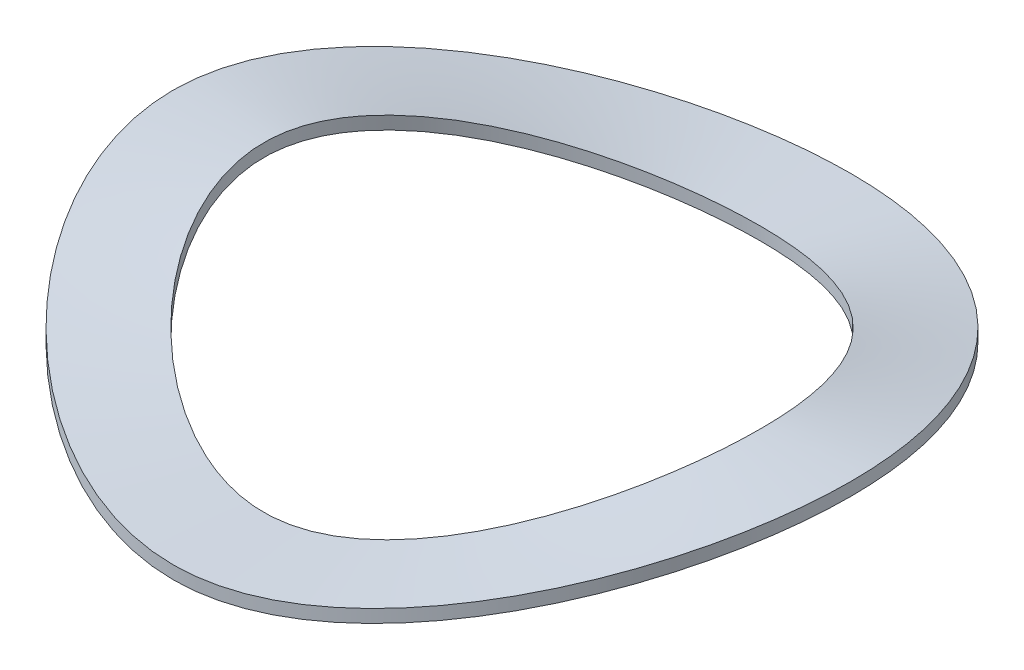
ISO-10303-21;
HEADER;
FILE_DESCRIPTION(('STEP AP214'),'2;1');
FILE_NAME('part.step','',(''),(''),'','','');
FILE_SCHEMA(('AUTOMOTIVE_DESIGN { 1 0 10303 214 1 1 1 1 }'));
ENDSEC;
DATA;
#1=APPLICATION_CONTEXT('core data for automotive mechanical design processes');
#2=APPLICATION_PROTOCOL_DEFINITION('international standard','automotive_design',2000,#1);
#3=PRODUCT_CONTEXT('',#1,'mechanical');
#4=PRODUCT('Part','Part','',(#3));
#5=PRODUCT_RELATED_PRODUCT_CATEGORY('part','',(#4));
#6=PRODUCT_DEFINITION_FORMATION('','',#4);
#7=PRODUCT_DEFINITION_CONTEXT('part definition',#1,'design');
#8=PRODUCT_DEFINITION('design','',#6,#7);
#9=PRODUCT_DEFINITION_SHAPE('','',#8);
#10=(LENGTH_UNIT() NAMED_UNIT(*) SI_UNIT(.MILLI.,.METRE.));
#11=(NAMED_UNIT(*) PLANE_ANGLE_UNIT() SI_UNIT($,.RADIAN.));
#12=(NAMED_UNIT(*) SI_UNIT($,.STERADIAN.) SOLID_ANGLE_UNIT());
#13=UNCERTAINTY_MEASURE_WITH_UNIT(LENGTH_MEASURE(1.E-05),#10,'distance_accuracy_value','');
#14=(GEOMETRIC_REPRESENTATION_CONTEXT(3) GLOBAL_UNCERTAINTY_ASSIGNED_CONTEXT((#13)) GLOBAL_UNIT_ASSIGNED_CONTEXT((#10,
#11,#12)) REPRESENTATION_CONTEXT('',''));
#15=CARTESIAN_POINT('',(0.,0.,0.));
#16=DIRECTION('',(0.,0.,1.));
#17=DIRECTION('',(1.,0.,0.));
#18=AXIS2_PLACEMENT_3D('',#15,#16,#17);
#19=CARTESIAN_POINT('',(0.,0.0888999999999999,-1.7018));
#20=CARTESIAN_POINT('',(0.8509,0.0889,-1.7018));
#21=CARTESIAN_POINT('',(2.5527,1.0795,0.));
#22=CARTESIAN_POINT('',(0.,-0.4064,2.5527));
#23=CARTESIAN_POINT('',(-2.5527,1.0795,0.));
#24=CARTESIAN_POINT('',(-0.8509,0.0888999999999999,-1.7018));
#25=CARTESIAN_POINT('',(0.,0.0888999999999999,-1.7018));
#26=CARTESIAN_POINT('',(0.,0.,-1.7018));
#27=CARTESIAN_POINT('',(0.8509,0.,-1.7018));
#28=CARTESIAN_POINT('',(2.5527,0.9906,0.));
#29=CARTESIAN_POINT('',(0.,-0.4953,2.5527));
#30=CARTESIAN_POINT('',(-2.5527,0.9906,0.));
#31=CARTESIAN_POINT('',(-0.8509,0.,-1.7018));
#32=CARTESIAN_POINT('',(0.,0.,-1.7018));
#33=B_SPLINE_SURFACE_WITH_KNOTS('',1,3,((#19,#20,#21,#22,#23,#24,#25),(#26,#27,#28,#29,#30,#31,
#32)),.UNSPECIFIED.,.F.,.T.,.F.,(2,2),(4,1,1,1,4),(0.,1.),(0.,0.25,0.5,0.75,1.),.UNSPECIFIED.);
#34=CARTESIAN_POINT('',(0.,0.0888999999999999,-1.7018));
#35=CARTESIAN_POINT('',(0.8509,0.0889,-1.7018));
#36=CARTESIAN_POINT('',(2.5527,1.0795,0.));
#37=CARTESIAN_POINT('',(0.,-0.4064,2.5527));
#38=CARTESIAN_POINT('',(-2.5527,1.0795,0.));
#39=CARTESIAN_POINT('',(-0.8509,0.0888999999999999,-1.7018));
#40=CARTESIAN_POINT('',(0.,0.0888999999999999,-1.7018));
#41=B_SPLINE_CURVE_WITH_KNOTS('',3,(#34,#35,#36,#37,#38,#39,#40),.UNSPECIFIED.,.T.,.F.,(4,1,1,1,
4),(0.,0.25,0.5,0.75,1.),.UNSPECIFIED.);
#42=CARTESIAN_POINT('',(0.,0.0888999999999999,-1.7018));
#43=VERTEX_POINT('',#42);
#44=EDGE_CURVE('E10',#43,#43,#41,.F.);
#45=CARTESIAN_POINT('',(0.,0.,-1.7018));
#46=CARTESIAN_POINT('',(0.8509,0.,-1.7018));
#47=CARTESIAN_POINT('',(2.5527,0.9906,0.));
#48=CARTESIAN_POINT('',(0.,-0.4953,2.5527));
#49=CARTESIAN_POINT('',(-2.5527,0.9906,0.));
#50=CARTESIAN_POINT('',(-0.8509,0.,-1.7018));
#51=CARTESIAN_POINT('',(0.,0.,-1.7018));
#52=B_SPLINE_CURVE_WITH_KNOTS('',3,(#45,#46,#47,#48,#49,#50,#51),.UNSPECIFIED.,.T.,.F.,(4,1,1,1,
4),(0.,0.25,0.5,0.75,1.),.UNSPECIFIED.);
#53=CARTESIAN_POINT('',(0.,0.,-1.7018));
#54=VERTEX_POINT('',#53);
#55=EDGE_CURVE('E48',#54,#54,#52,.T.);
#56=ORIENTED_EDGE('',*,*,#44,.T.);
#57=EDGE_LOOP('',(#56));
#58=FACE_BOUND('',#57,.T.);
#59=ORIENTED_EDGE('',*,*,#55,.T.);
#60=EDGE_LOOP('',(#59));
#61=FACE_BOUND('',#60,.T.);
#62=ADVANCED_FACE('F36',(#58,#61),#33,.T.);
#63=CARTESIAN_POINT('',(0.,0.0889,-2.3241));
#64=CARTESIAN_POINT('',(1.16205,0.0889,-2.3241));
#65=CARTESIAN_POINT('',(3.48615,1.0795,0.));
#66=CARTESIAN_POINT('',(0.,-0.4064,3.48615));
#67=CARTESIAN_POINT('',(-3.48615,1.0795,0.));
#68=CARTESIAN_POINT('',(-1.16205,0.0888999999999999,-2.3241));
#69=CARTESIAN_POINT('',(0.,0.0889,-2.3241));
#70=CARTESIAN_POINT('',(0.,0.0889,-1.7018));
#71=CARTESIAN_POINT('',(0.8509,0.0889,-1.7018));
#72=CARTESIAN_POINT('',(2.5527,1.0795,0.));
#73=CARTESIAN_POINT('',(0.,-0.4064,2.5527));
#74=CARTESIAN_POINT('',(-2.5527,1.0795,0.));
#75=CARTESIAN_POINT('',(-0.8509,0.0888999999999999,-1.7018));
#76=CARTESIAN_POINT('',(0.,0.0889,-1.7018));
#77=B_SPLINE_SURFACE_WITH_KNOTS('',1,3,((#63,#64,#65,#66,#67,#68,#69),(#70,#71,#72,#73,#74,#75,
#76)),.UNSPECIFIED.,.F.,.T.,.F.,(2,2),(4,1,1,1,4),(0.,1.),(0.,0.25,0.5,0.75,1.),.UNSPECIFIED.);
#78=CARTESIAN_POINT('',(0.,0.0889,-2.3241));
#79=CARTESIAN_POINT('',(1.16205,0.0889,-2.3241));
#80=CARTESIAN_POINT('',(3.48615,1.0795,0.));
#81=CARTESIAN_POINT('',(0.,-0.4064,3.48615));
#82=CARTESIAN_POINT('',(-3.48615,1.0795,0.));
#83=CARTESIAN_POINT('',(-1.16205,0.0888999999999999,-2.3241));
#84=CARTESIAN_POINT('',(0.,0.0889,-2.3241));
#85=B_SPLINE_CURVE_WITH_KNOTS('',3,(#78,#79,#80,#81,#82,#83,#84),.UNSPECIFIED.,.T.,.F.,(4,1,1,1,
4),(0.,0.25,0.5,0.75,1.),.UNSPECIFIED.);
#86=CARTESIAN_POINT('',(0.,0.0889,-2.3241));
#87=VERTEX_POINT('',#86);
#88=EDGE_CURVE('E42',#87,#87,#85,.T.);
#89=ORIENTED_EDGE('',*,*,#88,.F.);
#90=EDGE_LOOP('',(#89));
#91=FACE_BOUND('',#90,.T.);
#92=ORIENTED_EDGE('',*,*,#44,.F.);
#93=EDGE_LOOP('',(#92));
#94=FACE_BOUND('',#93,.T.);
#95=ADVANCED_FACE('F77',(#91,#94),#77,.T.);
#96=CARTESIAN_POINT('',(0.,0.,-1.7018));
#97=CARTESIAN_POINT('',(0.8509,0.,-1.7018));
#98=CARTESIAN_POINT('',(2.5527,0.9906,0.));
#99=CARTESIAN_POINT('',(0.,-0.4953,2.5527));
#100=CARTESIAN_POINT('',(-2.5527,0.9906,0.));
#101=CARTESIAN_POINT('',(-0.8509,0.,-1.7018));
#102=CARTESIAN_POINT('',(0.,0.,-1.7018));
#103=CARTESIAN_POINT('',(0.,0.,-2.3241));
#104=CARTESIAN_POINT('',(1.16205,0.,-2.3241));
#105=CARTESIAN_POINT('',(3.48615,0.9906,0.));
#106=CARTESIAN_POINT('',(0.,-0.4953,3.48615));
#107=CARTESIAN_POINT('',(-3.48615,0.9906,0.));
#108=CARTESIAN_POINT('',(-1.16205,0.,-2.3241));
#109=CARTESIAN_POINT('',(0.,0.,-2.3241));
#110=B_SPLINE_SURFACE_WITH_KNOTS('',1,3,((#96,#97,#98,#99,#100,#101,#102),(#103,#104,#105,#106,
#107,#108,#109)),.UNSPECIFIED.,.F.,.T.,.F.,(2,2),(4,1,1,1,4),(0.,1.),(0.,0.25,0.5,0.75,1.),.UNSPECIFIED.);
#111=CARTESIAN_POINT('',(0.,0.,-2.3241));
#112=CARTESIAN_POINT('',(1.16205,0.,-2.3241));
#113=CARTESIAN_POINT('',(3.48615,0.9906,0.));
#114=CARTESIAN_POINT('',(0.,-0.4953,3.48615));
#115=CARTESIAN_POINT('',(-3.48615,0.9906,0.));
#116=CARTESIAN_POINT('',(-1.16205,0.,-2.3241));
#117=CARTESIAN_POINT('',(0.,0.,-2.3241));
#118=B_SPLINE_CURVE_WITH_KNOTS('',3,(#111,#112,#113,#114,#115,#116,#117),.UNSPECIFIED.,.T.,.F.,
(4,1,1,1,4),(0.,0.25,0.5,0.75,1.),.UNSPECIFIED.);
#119=CARTESIAN_POINT('',(0.,0.,-2.3241));
#120=VERTEX_POINT('',#119);
#121=EDGE_CURVE('E53',#120,#120,#118,.T.);
#122=ORIENTED_EDGE('',*,*,#55,.F.);
#123=EDGE_LOOP('',(#122));
#124=FACE_BOUND('',#123,.T.);
#125=ORIENTED_EDGE('',*,*,#121,.T.);
#126=EDGE_LOOP('',(#125));
#127=FACE_BOUND('',#126,.T.);
#128=ADVANCED_FACE('F80',(#124,#127),#110,.T.);
#129=CARTESIAN_POINT('',(0.,0.,-2.3241));
#130=CARTESIAN_POINT('',(1.16205,0.,-2.3241));
#131=CARTESIAN_POINT('',(3.48615,0.9906,0.));
#132=CARTESIAN_POINT('',(0.,-0.4953,3.48615));
#133=CARTESIAN_POINT('',(-3.48615,0.9906,0.));
#134=CARTESIAN_POINT('',(-1.16205,0.,-2.3241));
#135=CARTESIAN_POINT('',(0.,0.,-2.3241));
#136=CARTESIAN_POINT('',(0.,0.0889,-2.3241));
#137=CARTESIAN_POINT('',(1.16205,0.0889,-2.3241));
#138=CARTESIAN_POINT('',(3.48615,1.0795,0.));
#139=CARTESIAN_POINT('',(0.,-0.4064,3.48615));
#140=CARTESIAN_POINT('',(-3.48615,1.0795,0.));
#141=CARTESIAN_POINT('',(-1.16205,0.0888999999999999,-2.3241));
#142=CARTESIAN_POINT('',(0.,0.0889,-2.3241));
#143=B_SPLINE_SURFACE_WITH_KNOTS('',1,3,((#129,#130,#131,#132,#133,#134,#135),(#136,#137,#138,
#139,#140,#141,#142)),.UNSPECIFIED.,.F.,.T.,.F.,(2,2),(4,1,1,1,4),(0.,1.),(0.,0.25,0.5,0.75,1.),.UNSPECIFIED.);
#144=ORIENTED_EDGE('',*,*,#121,.F.);
#145=EDGE_LOOP('',(#144));
#146=FACE_BOUND('',#145,.T.);
#147=ORIENTED_EDGE('',*,*,#88,.T.);
#148=EDGE_LOOP('',(#147));
#149=FACE_BOUND('',#148,.T.);
#150=ADVANCED_FACE('F38',(#146,#149),#143,.T.);
#151=CLOSED_SHELL('',(#62,#95,#128,#150));
#152=MANIFOLD_SOLID_BREP('B2',#151);
#153=ADVANCED_BREP_SHAPE_REPRESENTATION('',(#18,#152),#14);
#154=SHAPE_DEFINITION_REPRESENTATION(#9,#153);
ENDSEC;
END-ISO-10303-21;
